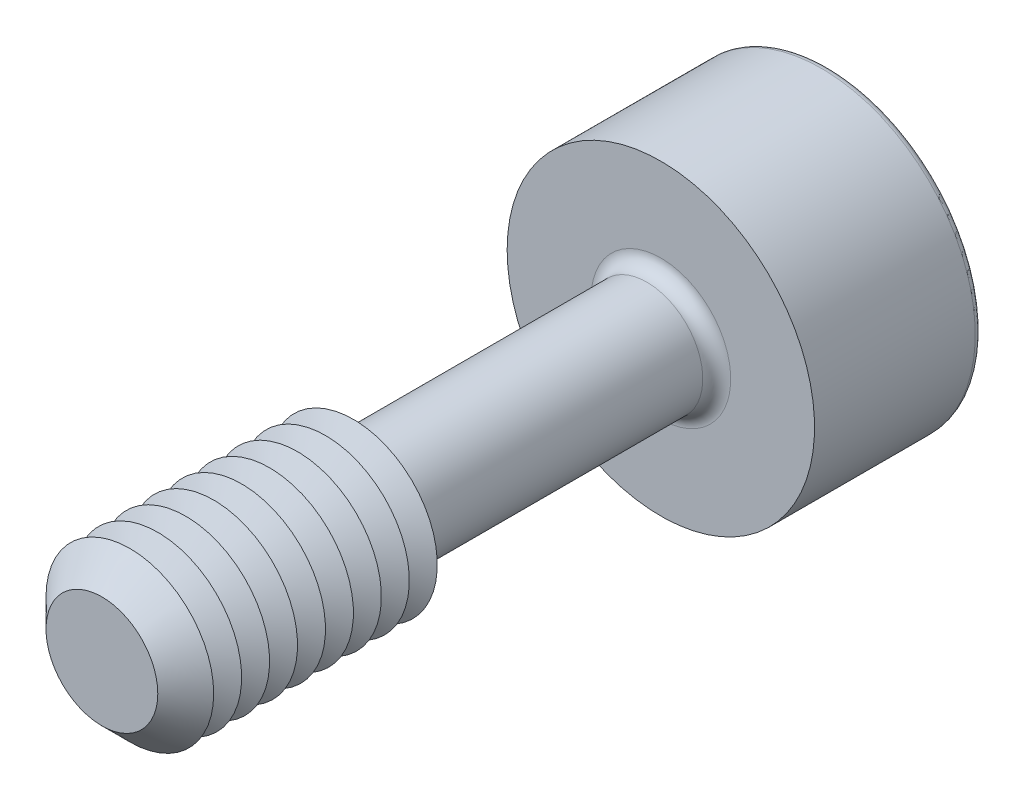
ISO-10303-21;
HEADER;
FILE_DESCRIPTION(('STEP AP214'),'2;1');
FILE_NAME('part.step','',(''),(''),'','','');
FILE_SCHEMA(('AUTOMOTIVE_DESIGN { 1 0 10303 214 1 1 1 1 }'));
ENDSEC;
DATA;
#1=APPLICATION_CONTEXT('core data for automotive mechanical design processes');
#2=APPLICATION_PROTOCOL_DEFINITION('international standard','automotive_design',2000,#1);
#3=PRODUCT_CONTEXT('',#1,'mechanical');
#4=PRODUCT('Part','Part','',(#3));
#5=PRODUCT_RELATED_PRODUCT_CATEGORY('part','',(#4));
#6=PRODUCT_DEFINITION_FORMATION('','',#4);
#7=PRODUCT_DEFINITION_CONTEXT('part definition',#1,'design');
#8=PRODUCT_DEFINITION('design','',#6,#7);
#9=PRODUCT_DEFINITION_SHAPE('','',#8);
#10=(LENGTH_UNIT() NAMED_UNIT(*) SI_UNIT(.MILLI.,.METRE.));
#11=(NAMED_UNIT(*) PLANE_ANGLE_UNIT() SI_UNIT($,.RADIAN.));
#12=(NAMED_UNIT(*) SI_UNIT($,.STERADIAN.) SOLID_ANGLE_UNIT());
#13=UNCERTAINTY_MEASURE_WITH_UNIT(LENGTH_MEASURE(1.E-05),#10,'distance_accuracy_value','');
#14=(GEOMETRIC_REPRESENTATION_CONTEXT(3) GLOBAL_UNCERTAINTY_ASSIGNED_CONTEXT((#13)) GLOBAL_UNIT_ASSIGNED_CONTEXT((#10,
#11,#12)) REPRESENTATION_CONTEXT('',''));
#15=CARTESIAN_POINT('',(0.,0.,0.));
#16=DIRECTION('',(0.,0.,1.));
#17=DIRECTION('',(1.,0.,0.));
#18=AXIS2_PLACEMENT_3D('',#15,#16,#17);
#19=CARTESIAN_POINT('',(-0.721687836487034,-1.25,-5.5));
#20=DIRECTION('',(0.,0.,1.));
#21=DIRECTION('',(1.,0.,0.));
#22=AXIS2_PLACEMENT_3D('',#19,#20,#21);
#23=PLANE('',#22);
#24=DIRECTION('',(1.,0.,0.));
#25=VECTOR('',#24,1.);
#26=CARTESIAN_POINT('',(-0.721687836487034,-1.25,-5.5));
#27=LINE('',#26,#25);
#28=CARTESIAN_POINT('',(0.,-1.25,-5.5));
#29=VERTEX_POINT('',#28);
#30=CARTESIAN_POINT('',(0.721687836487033,-1.25,-5.5));
#31=VERTEX_POINT('',#30);
#32=EDGE_CURVE('E411',#29,#31,#27,.T.);
#33=ORIENTED_EDGE('',*,*,#32,.F.);
#34=CARTESIAN_POINT('',(0.,0.,-5.5));
#35=DIRECTION('',(0.,0.,1.));
#36=DIRECTION('',(0.,-1.,0.));
#37=AXIS2_PLACEMENT_3D('',#34,#35,#36);
#38=CIRCLE('',#37,1.25);
#39=CARTESIAN_POINT('',(1.08253175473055,-0.624999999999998,-5.5));
#40=VERTEX_POINT('',#39);
#41=EDGE_CURVE('E53',#29,#40,#38,.T.);
#42=ORIENTED_EDGE('',*,*,#41,.T.);
#43=DIRECTION('',(0.499999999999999,0.866025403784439,0.));
#44=VECTOR('',#43,1.);
#45=CARTESIAN_POINT('',(0.721687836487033,-1.25,-5.5));
#46=LINE('',#45,#44);
#47=EDGE_CURVE('E401',#31,#40,#46,.T.);
#48=ORIENTED_EDGE('',*,*,#47,.F.);
#49=EDGE_LOOP('',(#33,#42,#48));
#50=FACE_BOUND('',#49,.T.);
#51=ADVANCED_FACE('F41',(#50),#23,.F.);
#52=CARTESIAN_POINT('',(1.44337567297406,0.,-5.5));
#53=VERTEX_POINT('',#52);
#54=EDGE_CURVE('E405',#40,#53,#46,.T.);
#55=ORIENTED_EDGE('',*,*,#54,.F.);
#56=CARTESIAN_POINT('',(1.08253175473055,0.625000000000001,-5.5));
#57=VERTEX_POINT('',#56);
#58=EDGE_CURVE('E11',#40,#57,#38,.T.);
#59=ORIENTED_EDGE('',*,*,#58,.T.);
#60=DIRECTION('',(-0.499999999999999,0.866025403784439,0.));
#61=VECTOR('',#60,1.);
#62=CARTESIAN_POINT('',(1.44337567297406,0.,-5.5));
#63=LINE('',#62,#61);
#64=EDGE_CURVE('E397',#53,#57,#63,.T.);
#65=ORIENTED_EDGE('',*,*,#64,.F.);
#66=EDGE_LOOP('',(#55,#59,#65));
#67=FACE_BOUND('',#66,.T.);
#68=ADVANCED_FACE('F133',(#67),#23,.F.);
#69=CARTESIAN_POINT('',(0.721687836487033,1.25,-5.5));
#70=VERTEX_POINT('',#69);
#71=EDGE_CURVE('E396',#57,#70,#63,.T.);
#72=ORIENTED_EDGE('',*,*,#71,.F.);
#73=CARTESIAN_POINT('',(0.,1.25,-5.5));
#74=VERTEX_POINT('',#73);
#75=EDGE_CURVE('E51',#57,#74,#38,.T.);
#76=ORIENTED_EDGE('',*,*,#75,.T.);
#77=DIRECTION('',(-1.,0.,0.));
#78=VECTOR('',#77,1.);
#79=CARTESIAN_POINT('',(0.721687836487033,1.25,-5.5));
#80=LINE('',#79,#78);
#81=EDGE_CURVE('E177',#70,#74,#80,.T.);
#82=ORIENTED_EDGE('',*,*,#81,.F.);
#83=EDGE_LOOP('',(#72,#76,#82));
#84=FACE_BOUND('',#83,.T.);
#85=ADVANCED_FACE('F139',(#84),#23,.F.);
#86=CARTESIAN_POINT('',(-0.721687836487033,1.25,-5.5));
#87=VERTEX_POINT('',#86);
#88=EDGE_CURVE('E402',#74,#87,#80,.T.);
#89=ORIENTED_EDGE('',*,*,#88,.F.);
#90=CARTESIAN_POINT('',(-1.08253175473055,0.625000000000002,-5.5));
#91=VERTEX_POINT('',#90);
#92=EDGE_CURVE('E266',#74,#91,#38,.T.);
#93=ORIENTED_EDGE('',*,*,#92,.T.);
#94=DIRECTION('',(-0.5,-0.866025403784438,0.));
#95=VECTOR('',#94,1.);
#96=CARTESIAN_POINT('',(-0.721687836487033,1.25,-5.5));
#97=LINE('',#96,#95);
#98=EDGE_CURVE('E176',#87,#91,#97,.T.);
#99=ORIENTED_EDGE('',*,*,#98,.F.);
#100=EDGE_LOOP('',(#89,#93,#99));
#101=FACE_BOUND('',#100,.T.);
#102=ADVANCED_FACE('F157',(#101),#23,.F.);
#103=CARTESIAN_POINT('',(-1.44337567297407,0.,-5.5));
#104=VERTEX_POINT('',#103);
#105=EDGE_CURVE('E170',#91,#104,#97,.T.);
#106=ORIENTED_EDGE('',*,*,#105,.F.);
#107=CARTESIAN_POINT('',(-1.08253175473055,-0.624999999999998,-5.5));
#108=VERTEX_POINT('',#107);
#109=EDGE_CURVE('E172',#91,#108,#38,.T.);
#110=ORIENTED_EDGE('',*,*,#109,.T.);
#111=DIRECTION('',(0.5,-0.866025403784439,0.));
#112=VECTOR('',#111,1.);
#113=CARTESIAN_POINT('',(-1.44337567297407,0.,-5.5));
#114=LINE('',#113,#112);
#115=EDGE_CURVE('E174',#104,#108,#114,.T.);
#116=ORIENTED_EDGE('',*,*,#115,.F.);
#117=EDGE_LOOP('',(#106,#110,#116));
#118=FACE_BOUND('',#117,.T.);
#119=ADVANCED_FACE('F146',(#118),#23,.F.);
#120=CARTESIAN_POINT('',(0.,0.,-8.));
#121=DIRECTION('',(0.,0.,-1.));
#122=DIRECTION('',(-1.,0.,0.));
#123=AXIS2_PLACEMENT_3D('',#120,#121,#122);
#124=PLANE('',#123);
#125=CARTESIAN_POINT('',(0.,0.,-8.));
#126=DIRECTION('',(0.,0.,-1.));
#127=DIRECTION('',(-1.,0.,0.));
#128=AXIS2_PLACEMENT_3D('',#125,#126,#127);
#129=CIRCLE('',#128,2.625);
#130=CARTESIAN_POINT('',(-2.625,0.,-8.));
#131=VERTEX_POINT('',#130);
#132=EDGE_CURVE('E249',#131,#131,#129,.T.);
#133=ORIENTED_EDGE('',*,*,#132,.T.);
#134=EDGE_LOOP('',(#133));
#135=FACE_BOUND('',#134,.T.);
#136=DIRECTION('',(-0.5,-0.866025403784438,0.));
#137=VECTOR('',#136,1.);
#138=CARTESIAN_POINT('',(-0.721687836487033,1.25,-8.));
#139=LINE('',#138,#137);
#140=CARTESIAN_POINT('',(-0.721687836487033,1.25,-8.));
#141=VERTEX_POINT('',#140);
#142=CARTESIAN_POINT('',(-1.44337567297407,0.,-8.));
#143=VERTEX_POINT('',#142);
#144=EDGE_CURVE('E211',#141,#143,#139,.T.);
#145=ORIENTED_EDGE('',*,*,#144,.T.);
#146=DIRECTION('',(0.5,-0.866025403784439,0.));
#147=VECTOR('',#146,1.);
#148=CARTESIAN_POINT('',(-1.44337567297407,0.,-8.));
#149=LINE('',#148,#147);
#150=CARTESIAN_POINT('',(-0.721687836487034,-1.25,-8.));
#151=VERTEX_POINT('',#150);
#152=EDGE_CURVE('E67',#143,#151,#149,.T.);
#153=ORIENTED_EDGE('',*,*,#152,.T.);
#154=DIRECTION('',(1.,0.,0.));
#155=VECTOR('',#154,1.);
#156=CARTESIAN_POINT('',(-0.721687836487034,-1.25,-8.));
#157=LINE('',#156,#155);
#158=CARTESIAN_POINT('',(0.721687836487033,-1.25,-8.));
#159=VERTEX_POINT('',#158);
#160=EDGE_CURVE('E195',#151,#159,#157,.T.);
#161=ORIENTED_EDGE('',*,*,#160,.T.);
#162=DIRECTION('',(0.499999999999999,0.866025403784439,0.));
#163=VECTOR('',#162,1.);
#164=CARTESIAN_POINT('',(0.721687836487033,-1.25,-8.));
#165=LINE('',#164,#163);
#166=CARTESIAN_POINT('',(1.44337567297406,0.,-8.));
#167=VERTEX_POINT('',#166);
#168=EDGE_CURVE('E199',#159,#167,#165,.T.);
#169=ORIENTED_EDGE('',*,*,#168,.T.);
#170=DIRECTION('',(-0.499999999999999,0.866025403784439,0.));
#171=VECTOR('',#170,1.);
#172=CARTESIAN_POINT('',(1.44337567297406,0.,-8.));
#173=LINE('',#172,#171);
#174=CARTESIAN_POINT('',(0.721687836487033,1.25,-8.));
#175=VERTEX_POINT('',#174);
#176=EDGE_CURVE('E203',#167,#175,#173,.T.);
#177=ORIENTED_EDGE('',*,*,#176,.T.);
#178=DIRECTION('',(-1.,0.,0.));
#179=VECTOR('',#178,1.);
#180=CARTESIAN_POINT('',(0.721687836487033,1.25,-8.));
#181=LINE('',#180,#179);
#182=EDGE_CURVE('E207',#175,#141,#181,.T.);
#183=ORIENTED_EDGE('',*,*,#182,.T.);
#184=EDGE_LOOP('',(#145,#153,#161,#169,#177,#183));
#185=FACE_BOUND('',#184,.T.);
#186=ADVANCED_FACE('F156',(#135,#185),#124,.T.);
#187=CARTESIAN_POINT('',(0.,0.,5.));
#188=DIRECTION('',(0.,0.,-1.));
#189=DIRECTION('',(-1.,0.,0.));
#190=AXIS2_PLACEMENT_3D('',#187,#188,#189);
#191=CYLINDRICAL_SURFACE('',#190,1.);
#192=CARTESIAN_POINT('',(0.,0.,-4.75));
#193=DIRECTION('',(0.,0.,-1.));
#194=DIRECTION('',(-1.,0.,0.));
#195=AXIS2_PLACEMENT_3D('',#192,#193,#194);
#196=CIRCLE('',#195,1.);
#197=CARTESIAN_POINT('',(-1.,0.,-4.75));
#198=VERTEX_POINT('',#197);
#199=EDGE_CURVE('E246',#198,#198,#196,.F.);
#200=ORIENTED_EDGE('',*,*,#199,.T.);
#201=EDGE_LOOP('',(#200));
#202=FACE_BOUND('',#201,.T.);
#203=CARTESIAN_POINT('',(0.,0.,0.21132486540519));
#204=DIRECTION('',(0.,0.,-1.));
#205=DIRECTION('',(0.,1.,0.));
#206=AXIS2_PLACEMENT_3D('',#203,#204,#205);
#207=CIRCLE('',#206,1.);
#208=CARTESIAN_POINT('',(0.,1.,0.21132486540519));
#209=VERTEX_POINT('',#208);
#210=EDGE_CURVE('E234',#209,#209,#207,.T.);
#211=ORIENTED_EDGE('',*,*,#210,.T.);
#212=EDGE_LOOP('',(#211));
#213=FACE_BOUND('',#212,.T.);
#214=ADVANCED_FACE('F163',(#202,#213),#191,.T.);
#215=CARTESIAN_POINT('',(0.,0.,0.21132486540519));
#216=DIRECTION('',(0.,0.,1.));
#217=DIRECTION('',(0.,-1.,0.));
#218=AXIS2_PLACEMENT_3D('',#215,#216,#217);
#219=CONICAL_SURFACE('',#218,1.,1.0471975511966);
#220=CARTESIAN_POINT('',(0.,0.,0.5));
#221=DIRECTION('',(0.,0.,-1.));
#222=DIRECTION('',(-1.,0.,0.));
#223=AXIS2_PLACEMENT_3D('',#220,#221,#222);
#224=CIRCLE('',#223,1.5);
#225=CARTESIAN_POINT('',(-1.5,0.,0.5));
#226=VERTEX_POINT('',#225);
#227=EDGE_CURVE('E270',#226,#226,#224,.T.);
#228=ORIENTED_EDGE('',*,*,#227,.T.);
#229=EDGE_LOOP('',(#228));
#230=FACE_BOUND('',#229,.T.);
#231=ORIENTED_EDGE('',*,*,#210,.F.);
#232=EDGE_LOOP('',(#231));
#233=FACE_BOUND('',#232,.T.);
#234=ADVANCED_FACE('F354',(#230,#233),#219,.T.);
#235=CARTESIAN_POINT('',(0.,0.,-5.));
#236=DIRECTION('',(0.,0.,-1.));
#237=DIRECTION('',(-1.,0.,0.));
#238=AXIS2_PLACEMENT_3D('',#235,#236,#237);
#239=PLANE('',#238);
#240=CARTESIAN_POINT('',(0.,0.,-5.));
#241=DIRECTION('',(0.,0.,-1.));
#242=DIRECTION('',(-1.,0.,0.));
#243=AXIS2_PLACEMENT_3D('',#240,#241,#242);
#244=CIRCLE('',#243,1.25);
#245=CARTESIAN_POINT('',(-1.25,0.,-5.));
#246=VERTEX_POINT('',#245);
#247=EDGE_CURVE('E242',#246,#246,#244,.T.);
#248=ORIENTED_EDGE('',*,*,#247,.T.);
#249=EDGE_LOOP('',(#248));
#250=FACE_BOUND('',#249,.T.);
#251=CARTESIAN_POINT('',(0.,0.,-5.));
#252=DIRECTION('',(0.,0.,-1.));
#253=DIRECTION('',(-1.,0.,0.));
#254=AXIS2_PLACEMENT_3D('',#251,#252,#253);
#255=CIRCLE('',#254,2.75);
#256=CARTESIAN_POINT('',(-2.75,0.,-5.));
#257=VERTEX_POINT('',#256);
#258=EDGE_CURVE('E230',#257,#257,#255,.T.);
#259=ORIENTED_EDGE('',*,*,#258,.F.);
#260=EDGE_LOOP('',(#259));
#261=FACE_BOUND('',#260,.T.);
#262=ADVANCED_FACE('F359',(#250,#261),#239,.F.);
#263=CARTESIAN_POINT('',(0.,0.,-8.));
#264=DIRECTION('',(0.,0.,1.));
#265=DIRECTION('',(1.,0.,0.));
#266=AXIS2_PLACEMENT_3D('',#263,#264,#265);
#267=CYLINDRICAL_SURFACE('',#266,2.75);
#268=CARTESIAN_POINT('',(0.,0.,-7.875));
#269=DIRECTION('',(0.,0.,-1.));
#270=DIRECTION('',(-1.,0.,0.));
#271=AXIS2_PLACEMENT_3D('',#268,#269,#270);
#272=CIRCLE('',#271,2.75);
#273=CARTESIAN_POINT('',(-2.75,0.,-7.875));
#274=VERTEX_POINT('',#273);
#275=EDGE_CURVE('E45',#274,#274,#272,.F.);
#276=ORIENTED_EDGE('',*,*,#275,.T.);
#277=EDGE_LOOP('',(#276));
#278=FACE_BOUND('',#277,.T.);
#279=ORIENTED_EDGE('',*,*,#258,.T.);
#280=EDGE_LOOP('',(#279));
#281=FACE_BOUND('',#280,.T.);
#282=ADVANCED_FACE('F360',(#278,#281),#267,.T.);
#283=CARTESIAN_POINT('',(-1.44337567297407,0.,-5.5));
#284=DIRECTION('',(0.866025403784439,0.5,0.));
#285=DIRECTION('',(-0.5,0.866025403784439,0.));
#286=AXIS2_PLACEMENT_3D('',#283,#284,#285);
#287=PLANE('',#286);
#288=ORIENTED_EDGE('',*,*,#152,.F.);
#289=DIRECTION('',(0.,0.,-1.));
#290=VECTOR('',#289,1.);
#291=CARTESIAN_POINT('',(-1.44337567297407,0.,-5.5));
#292=LINE('',#291,#290);
#293=EDGE_CURVE('E186',#104,#143,#292,.T.);
#294=ORIENTED_EDGE('',*,*,#293,.F.);
#295=ORIENTED_EDGE('',*,*,#115,.T.);
#296=CARTESIAN_POINT('',(-0.721687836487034,-1.25,-5.5));
#297=VERTEX_POINT('',#296);
#298=EDGE_CURVE('E214',#108,#297,#114,.T.);
#299=ORIENTED_EDGE('',*,*,#298,.T.);
#300=DIRECTION('',(0.,0.,-1.));
#301=VECTOR('',#300,1.);
#302=CARTESIAN_POINT('',(-0.721687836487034,-1.25,-5.5));
#303=LINE('',#302,#301);
#304=EDGE_CURVE('E227',#297,#151,#303,.T.);
#305=ORIENTED_EDGE('',*,*,#304,.T.);
#306=EDGE_LOOP('',(#288,#294,#295,#299,#305));
#307=FACE_BOUND('',#306,.T.);
#308=ADVANCED_FACE('F363',(#307),#287,.T.);
#309=CARTESIAN_POINT('',(-0.721687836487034,-1.25,-5.5));
#310=DIRECTION('',(0.,1.,0.));
#311=DIRECTION('',(0.,0.,1.));
#312=AXIS2_PLACEMENT_3D('',#309,#310,#311);
#313=PLANE('',#312);
#314=ORIENTED_EDGE('',*,*,#160,.F.);
#315=ORIENTED_EDGE('',*,*,#304,.F.);
#316=EDGE_CURVE('E408',#297,#29,#27,.T.);
#317=ORIENTED_EDGE('',*,*,#316,.T.);
#318=ORIENTED_EDGE('',*,*,#32,.T.);
#319=DIRECTION('',(0.,0.,-1.));
#320=VECTOR('',#319,1.);
#321=CARTESIAN_POINT('',(0.721687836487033,-1.25,-5.5));
#322=LINE('',#321,#320);
#323=EDGE_CURVE('E224',#31,#159,#322,.T.);
#324=ORIENTED_EDGE('',*,*,#323,.T.);
#325=EDGE_LOOP('',(#314,#315,#317,#318,#324));
#326=FACE_BOUND('',#325,.T.);
#327=ADVANCED_FACE('F369',(#326),#313,.T.);
#328=CARTESIAN_POINT('',(0.721687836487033,-1.25,-5.5));
#329=DIRECTION('',(-0.866025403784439,0.499999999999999,0.));
#330=DIRECTION('',(-0.499999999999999,-0.866025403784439,0.));
#331=AXIS2_PLACEMENT_3D('',#328,#329,#330);
#332=PLANE('',#331);
#333=ORIENTED_EDGE('',*,*,#168,.F.);
#334=ORIENTED_EDGE('',*,*,#323,.F.);
#335=ORIENTED_EDGE('',*,*,#47,.T.);
#336=ORIENTED_EDGE('',*,*,#54,.T.);
#337=DIRECTION('',(0.,0.,-1.));
#338=VECTOR('',#337,1.);
#339=CARTESIAN_POINT('',(1.44337567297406,0.,-5.5));
#340=LINE('',#339,#338);
#341=EDGE_CURVE('E221',#53,#167,#340,.T.);
#342=ORIENTED_EDGE('',*,*,#341,.T.);
#343=EDGE_LOOP('',(#333,#334,#335,#336,#342));
#344=FACE_BOUND('',#343,.T.);
#345=ADVANCED_FACE('F372',(#344),#332,.T.);
#346=CARTESIAN_POINT('',(1.44337567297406,0.,-5.5));
#347=DIRECTION('',(-0.866025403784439,-0.5,0.));
#348=DIRECTION('',(0.5,-0.866025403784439,0.));
#349=AXIS2_PLACEMENT_3D('',#346,#347,#348);
#350=PLANE('',#349);
#351=ORIENTED_EDGE('',*,*,#176,.F.);
#352=ORIENTED_EDGE('',*,*,#341,.F.);
#353=ORIENTED_EDGE('',*,*,#64,.T.);
#354=ORIENTED_EDGE('',*,*,#71,.T.);
#355=DIRECTION('',(0.,0.,-1.));
#356=VECTOR('',#355,1.);
#357=CARTESIAN_POINT('',(0.721687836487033,1.25,-5.5));
#358=LINE('',#357,#356);
#359=EDGE_CURVE('E218',#70,#175,#358,.T.);
#360=ORIENTED_EDGE('',*,*,#359,.T.);
#361=EDGE_LOOP('',(#351,#352,#353,#354,#360));
#362=FACE_BOUND('',#361,.T.);
#363=ADVANCED_FACE('F376',(#362),#350,.T.);
#364=CARTESIAN_POINT('',(0.721687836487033,1.25,-5.5));
#365=DIRECTION('',(0.,-1.,0.));
#366=DIRECTION('',(1.,0.,0.));
#367=AXIS2_PLACEMENT_3D('',#364,#365,#366);
#368=PLANE('',#367);
#369=ORIENTED_EDGE('',*,*,#182,.F.);
#370=ORIENTED_EDGE('',*,*,#359,.F.);
#371=ORIENTED_EDGE('',*,*,#81,.T.);
#372=ORIENTED_EDGE('',*,*,#88,.T.);
#373=DIRECTION('',(0.,0.,-1.));
#374=VECTOR('',#373,1.);
#375=CARTESIAN_POINT('',(-0.721687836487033,1.25,-5.5));
#376=LINE('',#375,#374);
#377=EDGE_CURVE('E182',#87,#141,#376,.T.);
#378=ORIENTED_EDGE('',*,*,#377,.T.);
#379=EDGE_LOOP('',(#369,#370,#371,#372,#378));
#380=FACE_BOUND('',#379,.T.);
#381=ADVANCED_FACE('F152',(#380),#368,.T.);
#382=CARTESIAN_POINT('',(-0.721687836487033,1.25,-5.5));
#383=DIRECTION('',(0.866025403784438,-0.5,0.));
#384=DIRECTION('',(0.5,0.866025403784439,0.));
#385=AXIS2_PLACEMENT_3D('',#382,#383,#384);
#386=PLANE('',#385);
#387=ORIENTED_EDGE('',*,*,#144,.F.);
#388=ORIENTED_EDGE('',*,*,#377,.F.);
#389=ORIENTED_EDGE('',*,*,#98,.T.);
#390=ORIENTED_EDGE('',*,*,#105,.T.);
#391=ORIENTED_EDGE('',*,*,#293,.T.);
#392=EDGE_LOOP('',(#387,#388,#389,#390,#391));
#393=FACE_BOUND('',#392,.T.);
#394=ADVANCED_FACE('F144',(#393),#386,.T.);
#395=ORIENTED_EDGE('',*,*,#298,.F.);
#396=EDGE_CURVE('E256',#108,#29,#38,.T.);
#397=ORIENTED_EDGE('',*,*,#396,.T.);
#398=ORIENTED_EDGE('',*,*,#316,.F.);
#399=EDGE_LOOP('',(#395,#397,#398));
#400=FACE_BOUND('',#399,.T.);
#401=ADVANCED_FACE('F135',(#400),#23,.F.);
#402=CARTESIAN_POINT('',(0.,0.,-4.75));
#403=DIRECTION('',(0.,0.,-1.));
#404=DIRECTION('',(-1.,0.,0.));
#405=AXIS2_PLACEMENT_3D('',#402,#403,#404);
#406=TOROIDAL_SURFACE('',#405,1.25,0.25);
#407=ORIENTED_EDGE('',*,*,#199,.F.);
#408=EDGE_LOOP('',(#407));
#409=FACE_BOUND('',#408,.T.);
#410=ORIENTED_EDGE('',*,*,#247,.F.);
#411=EDGE_LOOP('',(#410));
#412=FACE_BOUND('',#411,.T.);
#413=ADVANCED_FACE('F129',(#409,#412),#406,.F.);
#414=CARTESIAN_POINT('',(0.,0.,-7.875));
#415=DIRECTION('',(0.,0.,-1.));
#416=DIRECTION('',(-1.,0.,0.));
#417=AXIS2_PLACEMENT_3D('',#414,#415,#416);
#418=TOROIDAL_SURFACE('',#417,2.625,0.125);
#419=ORIENTED_EDGE('',*,*,#275,.F.);
#420=EDGE_LOOP('',(#419));
#421=FACE_BOUND('',#420,.T.);
#422=ORIENTED_EDGE('',*,*,#132,.F.);
#423=EDGE_LOOP('',(#422));
#424=FACE_BOUND('',#423,.T.);
#425=ADVANCED_FACE('F43',(#421,#424),#418,.T.);
#426=CARTESIAN_POINT('',(0.,0.,-4.77831216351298));
#427=DIRECTION('',(0.,0.,-1.));
#428=DIRECTION('',(0.,1.,0.));
#429=AXIS2_PLACEMENT_3D('',#426,#427,#428);
#430=CONICAL_SURFACE('',#429,0.,1.0471975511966);
#431=ORIENTED_EDGE('',*,*,#41,.F.);
#432=ORIENTED_EDGE('',*,*,#396,.F.);
#433=ORIENTED_EDGE('',*,*,#109,.F.);
#434=ORIENTED_EDGE('',*,*,#92,.F.);
#435=ORIENTED_EDGE('',*,*,#75,.F.);
#436=ORIENTED_EDGE('',*,*,#58,.F.);
#437=EDGE_LOOP('',(#431,#432,#433,#434,#435,#436));
#438=FACE_BOUND('',#437,.T.);
#439=CARTESIAN_POINT('',(0.,0.,-4.77831216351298));
#440=VERTEX_POINT('',#439);
#441=VERTEX_LOOP('',#440);
#442=FACE_BOUND('',#441,.T.);
#443=ADVANCED_FACE('F118',(#438,#442),#430,.F.);
#444=CARTESIAN_POINT('',(0.,0.,0.750000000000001));
#445=DIRECTION('',(0.,0.,-1.));
#446=DIRECTION('',(-1.,0.,0.));
#447=AXIS2_PLACEMENT_3D('',#444,#445,#446);
#448=CONICAL_SURFACE('',#447,1.06698729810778,1.0471975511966);
#449=ORIENTED_EDGE('',*,*,#227,.F.);
#450=EDGE_LOOP('',(#449));
#451=FACE_BOUND('',#450,.T.);
#452=CARTESIAN_POINT('',(0.,0.,0.750000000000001));
#453=DIRECTION('',(0.,0.,-1.));
#454=DIRECTION('',(-1.,0.,0.));
#455=AXIS2_PLACEMENT_3D('',#452,#453,#454);
#456=CIRCLE('',#455,1.06698729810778);
#457=CARTESIAN_POINT('',(-1.06698729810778,0.,0.750000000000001));
#458=VERTEX_POINT('',#457);
#459=EDGE_CURVE('E275',#458,#458,#456,.T.);
#460=ORIENTED_EDGE('',*,*,#459,.T.);
#461=EDGE_LOOP('',(#460));
#462=FACE_BOUND('',#461,.T.);
#463=ADVANCED_FACE('F120',(#451,#462),#448,.T.);
#464=CARTESIAN_POINT('',(0.,0.,1.));
#465=DIRECTION('',(0.,0.,1.));
#466=DIRECTION('',(1.,0.,0.));
#467=AXIS2_PLACEMENT_3D('',#464,#465,#466);
#468=CONICAL_SURFACE('',#467,1.5,1.0471975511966);
#469=ORIENTED_EDGE('',*,*,#459,.F.);
#470=EDGE_LOOP('',(#469));
#471=FACE_BOUND('',#470,.T.);
#472=CARTESIAN_POINT('',(0.,0.,1.));
#473=DIRECTION('',(0.,0.,-1.));
#474=DIRECTION('',(-1.,0.,0.));
#475=AXIS2_PLACEMENT_3D('',#472,#473,#474);
#476=CIRCLE('',#475,1.5);
#477=CARTESIAN_POINT('',(-1.5,0.,1.));
#478=VERTEX_POINT('',#477);
#479=EDGE_CURVE('E281',#478,#478,#476,.T.);
#480=ORIENTED_EDGE('',*,*,#479,.T.);
#481=EDGE_LOOP('',(#480));
#482=FACE_BOUND('',#481,.T.);
#483=ADVANCED_FACE('F126',(#471,#482),#468,.T.);
#484=CARTESIAN_POINT('',(0.,0.,1.25));
#485=DIRECTION('',(0.,0.,-1.));
#486=DIRECTION('',(-1.,0.,0.));
#487=AXIS2_PLACEMENT_3D('',#484,#485,#486);
#488=CONICAL_SURFACE('',#487,1.06698729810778,1.0471975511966);
#489=ORIENTED_EDGE('',*,*,#479,.F.);
#490=EDGE_LOOP('',(#489));
#491=FACE_BOUND('',#490,.T.);
#492=CARTESIAN_POINT('',(0.,0.,1.25));
#493=DIRECTION('',(0.,0.,-1.));
#494=DIRECTION('',(-1.,0.,0.));
#495=AXIS2_PLACEMENT_3D('',#492,#493,#494);
#496=CIRCLE('',#495,1.06698729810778);
#497=CARTESIAN_POINT('',(-1.06698729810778,0.,1.25));
#498=VERTEX_POINT('',#497);
#499=EDGE_CURVE('E287',#498,#498,#496,.T.);
#500=ORIENTED_EDGE('',*,*,#499,.T.);
#501=EDGE_LOOP('',(#500));
#502=FACE_BOUND('',#501,.T.);
#503=ADVANCED_FACE('F516',(#491,#502),#488,.T.);
#504=CARTESIAN_POINT('',(0.,0.,1.5));
#505=DIRECTION('',(0.,0.,1.));
#506=DIRECTION('',(1.,0.,0.));
#507=AXIS2_PLACEMENT_3D('',#504,#505,#506);
#508=CONICAL_SURFACE('',#507,1.5,1.0471975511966);
#509=ORIENTED_EDGE('',*,*,#499,.F.);
#510=EDGE_LOOP('',(#509));
#511=FACE_BOUND('',#510,.T.);
#512=CARTESIAN_POINT('',(0.,0.,1.5));
#513=DIRECTION('',(0.,0.,-1.));
#514=DIRECTION('',(-1.,0.,0.));
#515=AXIS2_PLACEMENT_3D('',#512,#513,#514);
#516=CIRCLE('',#515,1.5);
#517=CARTESIAN_POINT('',(-1.5,0.,1.5));
#518=VERTEX_POINT('',#517);
#519=EDGE_CURVE('E291',#518,#518,#516,.T.);
#520=ORIENTED_EDGE('',*,*,#519,.T.);
#521=EDGE_LOOP('',(#520));
#522=FACE_BOUND('',#521,.T.);
#523=ADVANCED_FACE('F525',(#511,#522),#508,.T.);
#524=CARTESIAN_POINT('',(0.,0.,1.75));
#525=DIRECTION('',(0.,0.,-1.));
#526=DIRECTION('',(-1.,0.,0.));
#527=AXIS2_PLACEMENT_3D('',#524,#525,#526);
#528=CONICAL_SURFACE('',#527,1.06698729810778,1.0471975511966);
#529=ORIENTED_EDGE('',*,*,#519,.F.);
#530=EDGE_LOOP('',(#529));
#531=FACE_BOUND('',#530,.T.);
#532=CARTESIAN_POINT('',(0.,0.,1.75));
#533=DIRECTION('',(0.,0.,-1.));
#534=DIRECTION('',(-1.,0.,0.));
#535=AXIS2_PLACEMENT_3D('',#532,#533,#534);
#536=CIRCLE('',#535,1.06698729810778);
#537=CARTESIAN_POINT('',(-1.06698729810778,0.,1.75));
#538=VERTEX_POINT('',#537);
#539=EDGE_CURVE('E295',#538,#538,#536,.T.);
#540=ORIENTED_EDGE('',*,*,#539,.T.);
#541=EDGE_LOOP('',(#540));
#542=FACE_BOUND('',#541,.T.);
#543=ADVANCED_FACE('F534',(#531,#542),#528,.T.);
#544=CARTESIAN_POINT('',(0.,0.,2.));
#545=DIRECTION('',(0.,0.,1.));
#546=DIRECTION('',(1.,0.,0.));
#547=AXIS2_PLACEMENT_3D('',#544,#545,#546);
#548=CONICAL_SURFACE('',#547,1.5,1.0471975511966);
#549=ORIENTED_EDGE('',*,*,#539,.F.);
#550=EDGE_LOOP('',(#549));
#551=FACE_BOUND('',#550,.T.);
#552=CARTESIAN_POINT('',(0.,0.,2.));
#553=DIRECTION('',(0.,0.,-1.));
#554=DIRECTION('',(-1.,0.,0.));
#555=AXIS2_PLACEMENT_3D('',#552,#553,#554);
#556=CIRCLE('',#555,1.5);
#557=CARTESIAN_POINT('',(-1.5,0.,2.));
#558=VERTEX_POINT('',#557);
#559=EDGE_CURVE('E298',#558,#558,#556,.T.);
#560=ORIENTED_EDGE('',*,*,#559,.T.);
#561=EDGE_LOOP('',(#560));
#562=FACE_BOUND('',#561,.T.);
#563=ADVANCED_FACE('F543',(#551,#562),#548,.T.);
#564=CARTESIAN_POINT('',(0.,0.,2.25));
#565=DIRECTION('',(0.,0.,-1.));
#566=DIRECTION('',(-1.,0.,0.));
#567=AXIS2_PLACEMENT_3D('',#564,#565,#566);
#568=CONICAL_SURFACE('',#567,1.06698729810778,1.0471975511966);
#569=ORIENTED_EDGE('',*,*,#559,.F.);
#570=EDGE_LOOP('',(#569));
#571=FACE_BOUND('',#570,.T.);
#572=CARTESIAN_POINT('',(0.,0.,2.25));
#573=DIRECTION('',(0.,0.,-1.));
#574=DIRECTION('',(-1.,0.,0.));
#575=AXIS2_PLACEMENT_3D('',#572,#573,#574);
#576=CIRCLE('',#575,1.06698729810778);
#577=CARTESIAN_POINT('',(-1.06698729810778,0.,2.25));
#578=VERTEX_POINT('',#577);
#579=EDGE_CURVE('E302',#578,#578,#576,.T.);
#580=ORIENTED_EDGE('',*,*,#579,.T.);
#581=EDGE_LOOP('',(#580));
#582=FACE_BOUND('',#581,.T.);
#583=ADVANCED_FACE('F552',(#571,#582),#568,.T.);
#584=CARTESIAN_POINT('',(0.,0.,2.5));
#585=DIRECTION('',(0.,0.,1.));
#586=DIRECTION('',(1.,0.,0.));
#587=AXIS2_PLACEMENT_3D('',#584,#585,#586);
#588=CONICAL_SURFACE('',#587,1.5,1.0471975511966);
#589=ORIENTED_EDGE('',*,*,#579,.F.);
#590=EDGE_LOOP('',(#589));
#591=FACE_BOUND('',#590,.T.);
#592=CARTESIAN_POINT('',(0.,0.,2.5));
#593=DIRECTION('',(0.,0.,-1.));
#594=DIRECTION('',(-1.,0.,0.));
#595=AXIS2_PLACEMENT_3D('',#592,#593,#594);
#596=CIRCLE('',#595,1.5);
#597=CARTESIAN_POINT('',(-1.5,0.,2.5));
#598=VERTEX_POINT('',#597);
#599=EDGE_CURVE('E306',#598,#598,#596,.T.);
#600=ORIENTED_EDGE('',*,*,#599,.T.);
#601=EDGE_LOOP('',(#600));
#602=FACE_BOUND('',#601,.T.);
#603=ADVANCED_FACE('F561',(#591,#602),#588,.T.);
#604=CARTESIAN_POINT('',(0.,0.,2.75));
#605=DIRECTION('',(0.,0.,-1.));
#606=DIRECTION('',(-1.,0.,0.));
#607=AXIS2_PLACEMENT_3D('',#604,#605,#606);
#608=CONICAL_SURFACE('',#607,1.06698729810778,1.0471975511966);
#609=ORIENTED_EDGE('',*,*,#599,.F.);
#610=EDGE_LOOP('',(#609));
#611=FACE_BOUND('',#610,.T.);
#612=CARTESIAN_POINT('',(0.,0.,2.75));
#613=DIRECTION('',(0.,0.,-1.));
#614=DIRECTION('',(-1.,0.,0.));
#615=AXIS2_PLACEMENT_3D('',#612,#613,#614);
#616=CIRCLE('',#615,1.06698729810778);
#617=CARTESIAN_POINT('',(-1.06698729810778,0.,2.75));
#618=VERTEX_POINT('',#617);
#619=EDGE_CURVE('E310',#618,#618,#616,.T.);
#620=ORIENTED_EDGE('',*,*,#619,.T.);
#621=EDGE_LOOP('',(#620));
#622=FACE_BOUND('',#621,.T.);
#623=ADVANCED_FACE('F570',(#611,#622),#608,.T.);
#624=CARTESIAN_POINT('',(0.,0.,3.));
#625=DIRECTION('',(0.,0.,1.));
#626=DIRECTION('',(1.,0.,0.));
#627=AXIS2_PLACEMENT_3D('',#624,#625,#626);
#628=CONICAL_SURFACE('',#627,1.5,1.0471975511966);
#629=ORIENTED_EDGE('',*,*,#619,.F.);
#630=EDGE_LOOP('',(#629));
#631=FACE_BOUND('',#630,.T.);
#632=CARTESIAN_POINT('',(0.,0.,3.));
#633=DIRECTION('',(0.,0.,-1.));
#634=DIRECTION('',(-1.,0.,0.));
#635=AXIS2_PLACEMENT_3D('',#632,#633,#634);
#636=CIRCLE('',#635,1.5);
#637=CARTESIAN_POINT('',(-1.5,0.,3.));
#638=VERTEX_POINT('',#637);
#639=EDGE_CURVE('E314',#638,#638,#636,.T.);
#640=ORIENTED_EDGE('',*,*,#639,.T.);
#641=EDGE_LOOP('',(#640));
#642=FACE_BOUND('',#641,.T.);
#643=ADVANCED_FACE('F579',(#631,#642),#628,.T.);
#644=CARTESIAN_POINT('',(0.,0.,3.25));
#645=DIRECTION('',(0.,0.,-1.));
#646=DIRECTION('',(-1.,0.,0.));
#647=AXIS2_PLACEMENT_3D('',#644,#645,#646);
#648=CONICAL_SURFACE('',#647,1.06698729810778,1.0471975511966);
#649=ORIENTED_EDGE('',*,*,#639,.F.);
#650=EDGE_LOOP('',(#649));
#651=FACE_BOUND('',#650,.T.);
#652=CARTESIAN_POINT('',(0.,0.,3.25));
#653=DIRECTION('',(0.,0.,-1.));
#654=DIRECTION('',(-1.,0.,0.));
#655=AXIS2_PLACEMENT_3D('',#652,#653,#654);
#656=CIRCLE('',#655,1.06698729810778);
#657=CARTESIAN_POINT('',(-1.06698729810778,0.,3.25));
#658=VERTEX_POINT('',#657);
#659=EDGE_CURVE('E318',#658,#658,#656,.T.);
#660=ORIENTED_EDGE('',*,*,#659,.T.);
#661=EDGE_LOOP('',(#660));
#662=FACE_BOUND('',#661,.T.);
#663=ADVANCED_FACE('F588',(#651,#662),#648,.T.);
#664=CARTESIAN_POINT('',(0.,0.,3.5));
#665=DIRECTION('',(0.,0.,1.));
#666=DIRECTION('',(1.,0.,0.));
#667=AXIS2_PLACEMENT_3D('',#664,#665,#666);
#668=CONICAL_SURFACE('',#667,1.5,1.0471975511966);
#669=ORIENTED_EDGE('',*,*,#659,.F.);
#670=EDGE_LOOP('',(#669));
#671=FACE_BOUND('',#670,.T.);
#672=CARTESIAN_POINT('',(0.,0.,3.5));
#673=DIRECTION('',(0.,0.,-1.));
#674=DIRECTION('',(-1.,0.,0.));
#675=AXIS2_PLACEMENT_3D('',#672,#673,#674);
#676=CIRCLE('',#675,1.5);
#677=CARTESIAN_POINT('',(-1.5,0.,3.5));
#678=VERTEX_POINT('',#677);
#679=EDGE_CURVE('E321',#678,#678,#676,.T.);
#680=ORIENTED_EDGE('',*,*,#679,.T.);
#681=EDGE_LOOP('',(#680));
#682=FACE_BOUND('',#681,.T.);
#683=ADVANCED_FACE('F597',(#671,#682),#668,.T.);
#684=CARTESIAN_POINT('',(0.,0.,3.75));
#685=DIRECTION('',(0.,0.,-1.));
#686=DIRECTION('',(-1.,0.,0.));
#687=AXIS2_PLACEMENT_3D('',#684,#685,#686);
#688=CONICAL_SURFACE('',#687,1.06698729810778,1.0471975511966);
#689=ORIENTED_EDGE('',*,*,#679,.F.);
#690=EDGE_LOOP('',(#689));
#691=FACE_BOUND('',#690,.T.);
#692=CARTESIAN_POINT('',(0.,0.,3.75));
#693=DIRECTION('',(0.,0.,-1.));
#694=DIRECTION('',(-1.,0.,0.));
#695=AXIS2_PLACEMENT_3D('',#692,#693,#694);
#696=CIRCLE('',#695,1.06698729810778);
#697=CARTESIAN_POINT('',(-1.06698729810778,0.,3.75));
#698=VERTEX_POINT('',#697);
#699=EDGE_CURVE('E324',#698,#698,#696,.T.);
#700=ORIENTED_EDGE('',*,*,#699,.T.);
#701=EDGE_LOOP('',(#700));
#702=FACE_BOUND('',#701,.T.);
#703=ADVANCED_FACE('F606',(#691,#702),#688,.T.);
#704=CARTESIAN_POINT('',(0.,0.,4.));
#705=DIRECTION('',(0.,0.,1.));
#706=DIRECTION('',(1.,0.,0.));
#707=AXIS2_PLACEMENT_3D('',#704,#705,#706);
#708=CONICAL_SURFACE('',#707,1.5,1.0471975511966);
#709=ORIENTED_EDGE('',*,*,#699,.F.);
#710=EDGE_LOOP('',(#709));
#711=FACE_BOUND('',#710,.T.);
#712=CARTESIAN_POINT('',(0.,0.,4.));
#713=DIRECTION('',(0.,0.,-1.));
#714=DIRECTION('',(-1.,0.,0.));
#715=AXIS2_PLACEMENT_3D('',#712,#713,#714);
#716=CIRCLE('',#715,1.5);
#717=CARTESIAN_POINT('',(-1.5,0.,4.));
#718=VERTEX_POINT('',#717);
#719=EDGE_CURVE('E327',#718,#718,#716,.T.);
#720=ORIENTED_EDGE('',*,*,#719,.T.);
#721=EDGE_LOOP('',(#720));
#722=FACE_BOUND('',#721,.T.);
#723=ADVANCED_FACE('F615',(#711,#722),#708,.T.);
#724=CARTESIAN_POINT('',(0.,0.,4.25));
#725=DIRECTION('',(0.,0.,-1.));
#726=DIRECTION('',(-1.,0.,0.));
#727=AXIS2_PLACEMENT_3D('',#724,#725,#726);
#728=CONICAL_SURFACE('',#727,1.06698729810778,1.0471975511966);
#729=ORIENTED_EDGE('',*,*,#719,.F.);
#730=EDGE_LOOP('',(#729));
#731=FACE_BOUND('',#730,.T.);
#732=CARTESIAN_POINT('',(0.,0.,4.25));
#733=DIRECTION('',(0.,0.,-1.));
#734=DIRECTION('',(-1.,0.,0.));
#735=AXIS2_PLACEMENT_3D('',#732,#733,#734);
#736=CIRCLE('',#735,1.06698729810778);
#737=CARTESIAN_POINT('',(-1.06698729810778,0.,4.25));
#738=VERTEX_POINT('',#737);
#739=EDGE_CURVE('E331',#738,#738,#736,.T.);
#740=ORIENTED_EDGE('',*,*,#739,.T.);
#741=EDGE_LOOP('',(#740));
#742=FACE_BOUND('',#741,.T.);
#743=ADVANCED_FACE('F624',(#731,#742),#728,.T.);
#744=CARTESIAN_POINT('',(0.,0.,4.5));
#745=DIRECTION('',(0.,0.,1.));
#746=DIRECTION('',(1.,0.,0.));
#747=AXIS2_PLACEMENT_3D('',#744,#745,#746);
#748=CONICAL_SURFACE('',#747,1.5,1.0471975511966);
#749=ORIENTED_EDGE('',*,*,#739,.F.);
#750=EDGE_LOOP('',(#749));
#751=FACE_BOUND('',#750,.T.);
#752=CARTESIAN_POINT('',(0.,0.,4.5));
#753=DIRECTION('',(0.,0.,-1.));
#754=DIRECTION('',(-1.,0.,0.));
#755=AXIS2_PLACEMENT_3D('',#752,#753,#754);
#756=CIRCLE('',#755,1.5);
#757=CARTESIAN_POINT('',(-1.5,0.,4.5));
#758=VERTEX_POINT('',#757);
#759=EDGE_CURVE('E335',#758,#758,#756,.T.);
#760=ORIENTED_EDGE('',*,*,#759,.T.);
#761=EDGE_LOOP('',(#760));
#762=FACE_BOUND('',#761,.T.);
#763=ADVANCED_FACE('F339',(#751,#762),#748,.T.);
#764=CARTESIAN_POINT('',(0.,0.,5.));
#765=DIRECTION('',(0.,0.,1.));
#766=DIRECTION('',(1.,0.,0.));
#767=AXIS2_PLACEMENT_3D('',#764,#765,#766);
#768=PLANE('',#767);
#769=CARTESIAN_POINT('',(0.,0.,5.));
#770=DIRECTION('',(0.,0.,1.));
#771=DIRECTION('',(1.,0.,0.));
#772=AXIS2_PLACEMENT_3D('',#769,#770,#771);
#773=CIRCLE('',#772,1.);
#774=CARTESIAN_POINT('',(1.,0.,5.));
#775=VERTEX_POINT('',#774);
#776=EDGE_CURVE('E238',#775,#775,#773,.T.);
#777=ORIENTED_EDGE('',*,*,#776,.T.);
#778=EDGE_LOOP('',(#777));
#779=FACE_BOUND('',#778,.T.);
#780=ADVANCED_FACE('F343',(#779),#768,.T.);
#781=CARTESIAN_POINT('',(0.,0.,4.5));
#782=DIRECTION('',(0.,0.,-1.));
#783=DIRECTION('',(0.,1.,0.));
#784=AXIS2_PLACEMENT_3D('',#781,#782,#783);
#785=CONICAL_SURFACE('',#784,1.5,0.78539816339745);
#786=ORIENTED_EDGE('',*,*,#776,.F.);
#787=EDGE_LOOP('',(#786));
#788=FACE_BOUND('',#787,.T.);
#789=ORIENTED_EDGE('',*,*,#759,.F.);
#790=EDGE_LOOP('',(#789));
#791=FACE_BOUND('',#790,.T.);
#792=ADVANCED_FACE('F341',(#788,#791),#785,.T.);
#793=CLOSED_SHELL('',(#51,#68,#85,#102,#119,#186,#214,#234,#262,#282,#308,#327,#345,#363,#381,
#394,#401,#413,#425,#443,#463,#483,#503,#523,#543,#563,#583,#603,#623,#643,#663,#683,#703,#723,
#743,#763,#780,#792));
#794=MANIFOLD_SOLID_BREP('B2',#793);
#795=ADVANCED_BREP_SHAPE_REPRESENTATION('',(#18,#794),#14);
#796=SHAPE_DEFINITION_REPRESENTATION(#9,#795);
ENDSEC;
END-ISO-10303-21;
